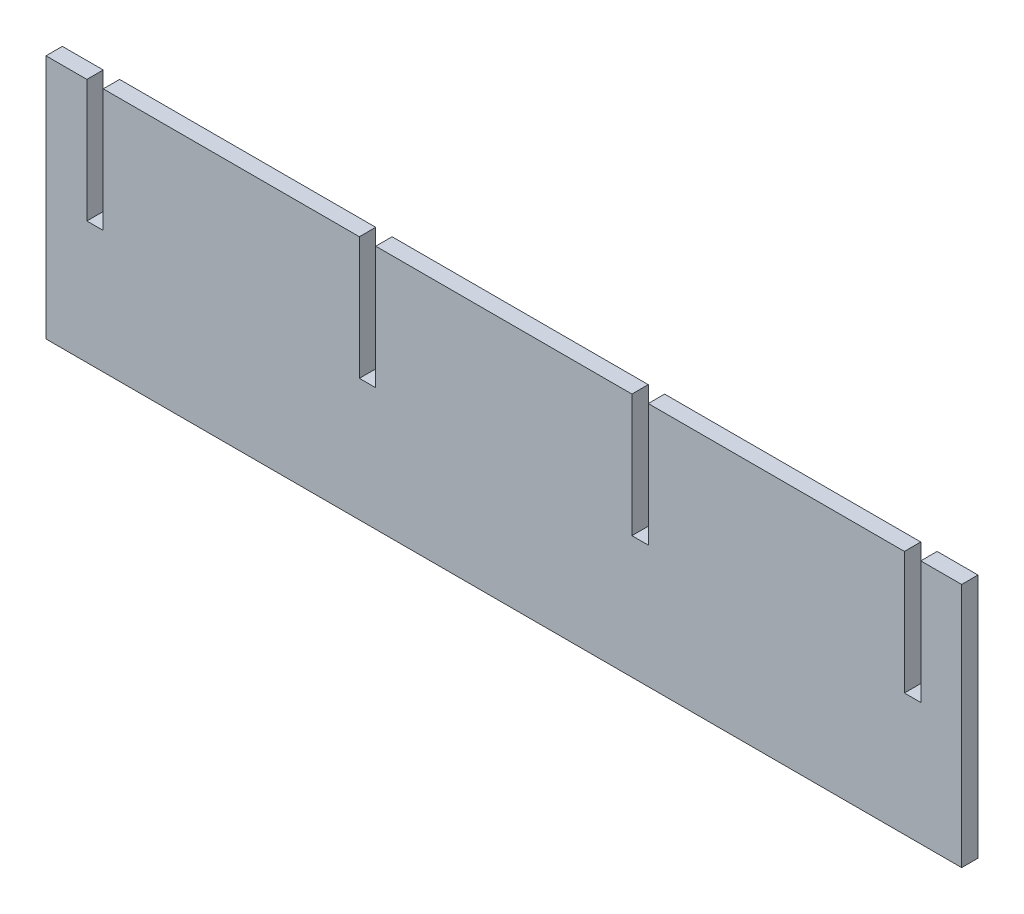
ISO-10303-21;
HEADER;
FILE_DESCRIPTION(('STEP AP214'),'2;1');
FILE_NAME('part.step','',(''),(''),'','','');
FILE_SCHEMA(('AUTOMOTIVE_DESIGN { 1 0 10303 214 1 1 1 1 }'));
ENDSEC;
DATA;
#1=APPLICATION_CONTEXT('core data for automotive mechanical design processes');
#2=APPLICATION_PROTOCOL_DEFINITION('international standard','automotive_design',2000,#1);
#3=PRODUCT_CONTEXT('',#1,'mechanical');
#4=PRODUCT('Part','Part','',(#3));
#5=PRODUCT_RELATED_PRODUCT_CATEGORY('part','',(#4));
#6=PRODUCT_DEFINITION_FORMATION('','',#4);
#7=PRODUCT_DEFINITION_CONTEXT('part definition',#1,'design');
#8=PRODUCT_DEFINITION('design','',#6,#7);
#9=PRODUCT_DEFINITION_SHAPE('','',#8);
#10=(LENGTH_UNIT() NAMED_UNIT(*) SI_UNIT(.MILLI.,.METRE.));
#11=(NAMED_UNIT(*) PLANE_ANGLE_UNIT() SI_UNIT($,.RADIAN.));
#12=(NAMED_UNIT(*) SI_UNIT($,.STERADIAN.) SOLID_ANGLE_UNIT());
#13=UNCERTAINTY_MEASURE_WITH_UNIT(LENGTH_MEASURE(1.E-05),#10,'distance_accuracy_value','');
#14=(GEOMETRIC_REPRESENTATION_CONTEXT(3) GLOBAL_UNCERTAINTY_ASSIGNED_CONTEXT((#13)) GLOBAL_UNIT_ASSIGNED_CONTEXT((#10,
#11,#12)) REPRESENTATION_CONTEXT('',''));
#15=CARTESIAN_POINT('',(0.,0.,0.));
#16=DIRECTION('',(0.,0.,1.));
#17=DIRECTION('',(1.,0.,0.));
#18=AXIS2_PLACEMENT_3D('',#15,#16,#17);
#19=CARTESIAN_POINT('',(0.,90.,12.));
#20=DIRECTION('',(0.,1.,0.));
#21=DIRECTION('',(-1.,0.,0.));
#22=AXIS2_PLACEMENT_3D('',#19,#20,#21);
#23=PLANE('',#22);
#24=DIRECTION('',(1.,0.,0.));
#25=VECTOR('',#24,1.);
#26=CARTESIAN_POINT('',(0.,90.,0.));
#27=LINE('',#26,#25);
#28=CARTESIAN_POINT('',(-294.,89.9999999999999,0.));
#29=VERTEX_POINT('',#28);
#30=CARTESIAN_POINT('',(-106.,90.,0.));
#31=VERTEX_POINT('',#30);
#32=EDGE_CURVE('E223',#29,#31,#27,.T.);
#33=ORIENTED_EDGE('',*,*,#32,.F.);
#34=DIRECTION('',(0.,0.,-1.));
#35=VECTOR('',#34,1.);
#36=CARTESIAN_POINT('',(-294.,89.9999999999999,12.));
#37=LINE('',#36,#35);
#38=CARTESIAN_POINT('',(-294.,89.9999999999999,12.));
#39=VERTEX_POINT('',#38);
#40=EDGE_CURVE('E11',#39,#29,#37,.T.);
#41=ORIENTED_EDGE('',*,*,#40,.F.);
#42=DIRECTION('',(1.,0.,0.));
#43=VECTOR('',#42,1.);
#44=CARTESIAN_POINT('',(0.,90.,12.));
#45=LINE('',#44,#43);
#46=CARTESIAN_POINT('',(-106.,90.,12.));
#47=VERTEX_POINT('',#46);
#48=EDGE_CURVE('E286',#39,#47,#45,.T.);
#49=ORIENTED_EDGE('',*,*,#48,.T.);
#50=DIRECTION('',(0.,0.,-1.));
#51=VECTOR('',#50,1.);
#52=CARTESIAN_POINT('',(-106.,90.,12.));
#53=LINE('',#52,#51);
#54=EDGE_CURVE('E67',#47,#31,#53,.T.);
#55=ORIENTED_EDGE('',*,*,#54,.T.);
#56=EDGE_LOOP('',(#33,#41,#49,#55));
#57=FACE_BOUND('',#56,.T.);
#58=ADVANCED_FACE('F49',(#57),#23,.T.);
#59=CARTESIAN_POINT('',(-294.,-1.81336427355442E-13,12.));
#60=DIRECTION('',(1.,0.,0.));
#61=DIRECTION('',(0.,1.,0.));
#62=AXIS2_PLACEMENT_3D('',#59,#60,#61);
#63=PLANE('',#62);
#64=DIRECTION('',(0.,-1.,0.));
#65=VECTOR('',#64,1.);
#66=CARTESIAN_POINT('',(-294.,-1.81336427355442E-13,0.));
#67=LINE('',#66,#65);
#68=CARTESIAN_POINT('',(-294.,0.,0.));
#69=VERTEX_POINT('',#68);
#70=EDGE_CURVE('E226',#29,#69,#67,.T.);
#71=ORIENTED_EDGE('',*,*,#70,.T.);
#72=DIRECTION('',(0.,0.,-1.));
#73=VECTOR('',#72,1.);
#74=CARTESIAN_POINT('',(-294.,0.,12.));
#75=LINE('',#74,#73);
#76=CARTESIAN_POINT('',(-294.,0.,12.));
#77=VERTEX_POINT('',#76);
#78=EDGE_CURVE('E59',#77,#69,#75,.T.);
#79=ORIENTED_EDGE('',*,*,#78,.F.);
#80=DIRECTION('',(0.,-1.,0.));
#81=VECTOR('',#80,1.);
#82=CARTESIAN_POINT('',(-294.,-1.81336427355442E-13,12.));
#83=LINE('',#82,#81);
#84=EDGE_CURVE('E359',#39,#77,#83,.T.);
#85=ORIENTED_EDGE('',*,*,#84,.F.);
#86=ORIENTED_EDGE('',*,*,#40,.T.);
#87=EDGE_LOOP('',(#71,#79,#85,#86));
#88=FACE_BOUND('',#87,.T.);
#89=ADVANCED_FACE('F51',(#88),#63,.F.);
#90=CARTESIAN_POINT('',(0.,0.,12.));
#91=DIRECTION('',(0.,1.,0.));
#92=DIRECTION('',(-1.,0.,0.));
#93=AXIS2_PLACEMENT_3D('',#90,#91,#92);
#94=PLANE('',#93);
#95=DIRECTION('',(1.,0.,0.));
#96=VECTOR('',#95,1.);
#97=CARTESIAN_POINT('',(0.,0.,0.));
#98=LINE('',#97,#96);
#99=CARTESIAN_POINT('',(-306.,0.,0.));
#100=VERTEX_POINT('',#99);
#101=EDGE_CURVE('E232',#100,#69,#98,.T.);
#102=ORIENTED_EDGE('',*,*,#101,.F.);
#103=DIRECTION('',(0.,0.,-1.));
#104=VECTOR('',#103,1.);
#105=CARTESIAN_POINT('',(-306.,0.,12.));
#106=LINE('',#105,#104);
#107=CARTESIAN_POINT('',(-306.,0.,12.));
#108=VERTEX_POINT('',#107);
#109=EDGE_CURVE('E333',#108,#100,#106,.T.);
#110=ORIENTED_EDGE('',*,*,#109,.F.);
#111=DIRECTION('',(1.,0.,0.));
#112=VECTOR('',#111,1.);
#113=CARTESIAN_POINT('',(0.,0.,12.));
#114=LINE('',#113,#112);
#115=EDGE_CURVE('E344',#108,#77,#114,.T.);
#116=ORIENTED_EDGE('',*,*,#115,.T.);
#117=ORIENTED_EDGE('',*,*,#78,.T.);
#118=EDGE_LOOP('',(#102,#110,#116,#117));
#119=FACE_BOUND('',#118,.T.);
#120=ADVANCED_FACE('F342',(#119),#94,.T.);
#121=CARTESIAN_POINT('',(-306.,-1.88737914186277E-13,12.));
#122=DIRECTION('',(1.,0.,0.));
#123=DIRECTION('',(0.,1.,0.));
#124=AXIS2_PLACEMENT_3D('',#121,#122,#123);
#125=PLANE('',#124);
#126=DIRECTION('',(0.,-1.,0.));
#127=VECTOR('',#126,1.);
#128=CARTESIAN_POINT('',(-306.,-1.88737914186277E-13,0.));
#129=LINE('',#128,#127);
#130=CARTESIAN_POINT('',(-306.,89.9999999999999,0.));
#131=VERTEX_POINT('',#130);
#132=EDGE_CURVE('E236',#131,#100,#129,.T.);
#133=ORIENTED_EDGE('',*,*,#132,.F.);
#134=DIRECTION('',(0.,0.,-1.));
#135=VECTOR('',#134,1.);
#136=CARTESIAN_POINT('',(-306.,89.9999999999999,12.));
#137=LINE('',#136,#135);
#138=CARTESIAN_POINT('',(-306.,89.9999999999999,12.));
#139=VERTEX_POINT('',#138);
#140=EDGE_CURVE('E330',#139,#131,#137,.T.);
#141=ORIENTED_EDGE('',*,*,#140,.F.);
#142=DIRECTION('',(0.,-1.,0.));
#143=VECTOR('',#142,1.);
#144=CARTESIAN_POINT('',(-306.,-1.88737914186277E-13,12.));
#145=LINE('',#144,#143);
#146=EDGE_CURVE('E356',#139,#108,#145,.T.);
#147=ORIENTED_EDGE('',*,*,#146,.T.);
#148=ORIENTED_EDGE('',*,*,#109,.T.);
#149=EDGE_LOOP('',(#133,#141,#147,#148));
#150=FACE_BOUND('',#149,.T.);
#151=ADVANCED_FACE('F353',(#150),#125,.T.);
#152=CARTESIAN_POINT('',(-336.,89.9999999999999,0.));
#153=VERTEX_POINT('',#152);
#154=EDGE_CURVE('E228',#153,#131,#27,.T.);
#155=ORIENTED_EDGE('',*,*,#154,.F.);
#156=DIRECTION('',(0.,0.,-1.));
#157=VECTOR('',#156,1.);
#158=CARTESIAN_POINT('',(-336.,89.9999999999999,12.));
#159=LINE('',#158,#157);
#160=CARTESIAN_POINT('',(-336.,89.9999999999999,12.));
#161=VERTEX_POINT('',#160);
#162=EDGE_CURVE('E327',#161,#153,#159,.T.);
#163=ORIENTED_EDGE('',*,*,#162,.F.);
#164=EDGE_CURVE('E366',#161,#139,#45,.T.);
#165=ORIENTED_EDGE('',*,*,#164,.T.);
#166=ORIENTED_EDGE('',*,*,#140,.T.);
#167=EDGE_LOOP('',(#155,#163,#165,#166));
#168=FACE_BOUND('',#167,.T.);
#169=ADVANCED_FACE('F486',(#168),#23,.T.);
#170=CARTESIAN_POINT('',(-336.,0.,12.));
#171=DIRECTION('',(-1.,0.,0.));
#172=DIRECTION('',(0.,0.,1.));
#173=AXIS2_PLACEMENT_3D('',#170,#171,#172);
#174=PLANE('',#173);
#175=DIRECTION('',(0.,1.,0.));
#176=VECTOR('',#175,1.);
#177=CARTESIAN_POINT('',(-336.,0.,0.));
#178=LINE('',#177,#176);
#179=CARTESIAN_POINT('',(-336.,-90.0000000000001,0.));
#180=VERTEX_POINT('',#179);
#181=EDGE_CURVE('E240',#180,#153,#178,.T.);
#182=ORIENTED_EDGE('',*,*,#181,.F.);
#183=DIRECTION('',(0.,0.,-1.));
#184=VECTOR('',#183,1.);
#185=CARTESIAN_POINT('',(-336.,-90.0000000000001,12.));
#186=LINE('',#185,#184);
#187=CARTESIAN_POINT('',(-336.,-90.0000000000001,12.));
#188=VERTEX_POINT('',#187);
#189=EDGE_CURVE('E324',#188,#180,#186,.T.);
#190=ORIENTED_EDGE('',*,*,#189,.F.);
#191=DIRECTION('',(0.,1.,0.));
#192=VECTOR('',#191,1.);
#193=CARTESIAN_POINT('',(-336.,0.,12.));
#194=LINE('',#193,#192);
#195=EDGE_CURVE('E371',#188,#161,#194,.T.);
#196=ORIENTED_EDGE('',*,*,#195,.T.);
#197=ORIENTED_EDGE('',*,*,#162,.T.);
#198=EDGE_LOOP('',(#182,#190,#196,#197));
#199=FACE_BOUND('',#198,.T.);
#200=ADVANCED_FACE('F495',(#199),#174,.T.);
#201=CARTESIAN_POINT('',(0.,-90.,12.));
#202=DIRECTION('',(0.,1.,0.));
#203=DIRECTION('',(-1.,0.,0.));
#204=AXIS2_PLACEMENT_3D('',#201,#202,#203);
#205=PLANE('',#204);
#206=DIRECTION('',(1.,0.,0.));
#207=VECTOR('',#206,1.);
#208=CARTESIAN_POINT('',(0.,-90.,0.));
#209=LINE('',#208,#207);
#210=CARTESIAN_POINT('',(336.,-90.,0.));
#211=VERTEX_POINT('',#210);
#212=EDGE_CURVE('E244',#180,#211,#209,.T.);
#213=ORIENTED_EDGE('',*,*,#212,.T.);
#214=DIRECTION('',(0.,0.,-1.));
#215=VECTOR('',#214,1.);
#216=CARTESIAN_POINT('',(336.,-90.,12.));
#217=LINE('',#216,#215);
#218=CARTESIAN_POINT('',(336.,-90.,12.));
#219=VERTEX_POINT('',#218);
#220=EDGE_CURVE('E320',#219,#211,#217,.T.);
#221=ORIENTED_EDGE('',*,*,#220,.F.);
#222=DIRECTION('',(1.,0.,0.));
#223=VECTOR('',#222,1.);
#224=CARTESIAN_POINT('',(0.,-90.,12.));
#225=LINE('',#224,#223);
#226=EDGE_CURVE('E375',#188,#219,#225,.T.);
#227=ORIENTED_EDGE('',*,*,#226,.F.);
#228=ORIENTED_EDGE('',*,*,#189,.T.);
#229=EDGE_LOOP('',(#213,#221,#227,#228));
#230=FACE_BOUND('',#229,.T.);
#231=ADVANCED_FACE('F601',(#230),#205,.F.);
#232=CARTESIAN_POINT('',(336.,0.,12.));
#233=DIRECTION('',(-1.,0.,0.));
#234=DIRECTION('',(0.,0.,1.));
#235=AXIS2_PLACEMENT_3D('',#232,#233,#234);
#236=PLANE('',#235);
#237=DIRECTION('',(0.,1.,0.));
#238=VECTOR('',#237,1.);
#239=CARTESIAN_POINT('',(336.,0.,0.));
#240=LINE('',#239,#238);
#241=CARTESIAN_POINT('',(336.,90.,0.));
#242=VERTEX_POINT('',#241);
#243=EDGE_CURVE('E247',#211,#242,#240,.T.);
#244=ORIENTED_EDGE('',*,*,#243,.T.);
#245=DIRECTION('',(0.,0.,-1.));
#246=VECTOR('',#245,1.);
#247=CARTESIAN_POINT('',(336.,90.,12.));
#248=LINE('',#247,#246);
#249=CARTESIAN_POINT('',(336.,90.,12.));
#250=VERTEX_POINT('',#249);
#251=EDGE_CURVE('E317',#250,#242,#248,.T.);
#252=ORIENTED_EDGE('',*,*,#251,.F.);
#253=DIRECTION('',(0.,1.,0.));
#254=VECTOR('',#253,1.);
#255=CARTESIAN_POINT('',(336.,0.,12.));
#256=LINE('',#255,#254);
#257=EDGE_CURVE('E378',#219,#250,#256,.T.);
#258=ORIENTED_EDGE('',*,*,#257,.F.);
#259=ORIENTED_EDGE('',*,*,#220,.T.);
#260=EDGE_LOOP('',(#244,#252,#258,#259));
#261=FACE_BOUND('',#260,.T.);
#262=ADVANCED_FACE('F436',(#261),#236,.F.);
#263=CARTESIAN_POINT('',(306.,90.,0.));
#264=VERTEX_POINT('',#263);
#265=EDGE_CURVE('E251',#264,#242,#27,.T.);
#266=ORIENTED_EDGE('',*,*,#265,.F.);
#267=DIRECTION('',(0.,0.,-1.));
#268=VECTOR('',#267,1.);
#269=CARTESIAN_POINT('',(306.,90.,12.));
#270=LINE('',#269,#268);
#271=CARTESIAN_POINT('',(306.,90.,12.));
#272=VERTEX_POINT('',#271);
#273=EDGE_CURVE('E314',#272,#264,#270,.T.);
#274=ORIENTED_EDGE('',*,*,#273,.F.);
#275=EDGE_CURVE('E381',#272,#250,#45,.T.);
#276=ORIENTED_EDGE('',*,*,#275,.T.);
#277=ORIENTED_EDGE('',*,*,#251,.T.);
#278=EDGE_LOOP('',(#266,#274,#276,#277));
#279=FACE_BOUND('',#278,.T.);
#280=ADVANCED_FACE('F426',(#279),#23,.T.);
#281=CARTESIAN_POINT('',(306.,1.88737914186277E-13,12.));
#282=DIRECTION('',(1.,0.,0.));
#283=DIRECTION('',(0.,1.,0.));
#284=AXIS2_PLACEMENT_3D('',#281,#282,#283);
#285=PLANE('',#284);
#286=DIRECTION('',(0.,-1.,0.));
#287=VECTOR('',#286,1.);
#288=CARTESIAN_POINT('',(306.,1.88737914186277E-13,0.));
#289=LINE('',#288,#287);
#290=CARTESIAN_POINT('',(306.,0.,0.));
#291=VERTEX_POINT('',#290);
#292=EDGE_CURVE('E252',#264,#291,#289,.T.);
#293=ORIENTED_EDGE('',*,*,#292,.T.);
#294=DIRECTION('',(0.,0.,-1.));
#295=VECTOR('',#294,1.);
#296=CARTESIAN_POINT('',(306.,0.,12.));
#297=LINE('',#296,#295);
#298=CARTESIAN_POINT('',(306.,0.,12.));
#299=VERTEX_POINT('',#298);
#300=EDGE_CURVE('E311',#299,#291,#297,.T.);
#301=ORIENTED_EDGE('',*,*,#300,.F.);
#302=DIRECTION('',(0.,-1.,0.));
#303=VECTOR('',#302,1.);
#304=CARTESIAN_POINT('',(306.,1.88737914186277E-13,12.));
#305=LINE('',#304,#303);
#306=EDGE_CURVE('E382',#272,#299,#305,.T.);
#307=ORIENTED_EDGE('',*,*,#306,.F.);
#308=ORIENTED_EDGE('',*,*,#273,.T.);
#309=EDGE_LOOP('',(#293,#301,#307,#308));
#310=FACE_BOUND('',#309,.T.);
#311=ADVANCED_FACE('F477',(#310),#285,.F.);
#312=CARTESIAN_POINT('',(0.,0.,12.));
#313=DIRECTION('',(0.,1.,0.));
#314=DIRECTION('',(-1.,0.,0.));
#315=AXIS2_PLACEMENT_3D('',#312,#313,#314);
#316=PLANE('',#315);
#317=DIRECTION('',(1.,0.,0.));
#318=VECTOR('',#317,1.);
#319=CARTESIAN_POINT('',(0.,0.,0.));
#320=LINE('',#319,#318);
#321=CARTESIAN_POINT('',(294.,0.,0.));
#322=VERTEX_POINT('',#321);
#323=EDGE_CURVE('E256',#322,#291,#320,.T.);
#324=ORIENTED_EDGE('',*,*,#323,.F.);
#325=DIRECTION('',(0.,0.,-1.));
#326=VECTOR('',#325,1.);
#327=CARTESIAN_POINT('',(294.,0.,12.));
#328=LINE('',#327,#326);
#329=CARTESIAN_POINT('',(294.,0.,12.));
#330=VERTEX_POINT('',#329);
#331=EDGE_CURVE('E308',#330,#322,#328,.T.);
#332=ORIENTED_EDGE('',*,*,#331,.F.);
#333=DIRECTION('',(1.,0.,0.));
#334=VECTOR('',#333,1.);
#335=CARTESIAN_POINT('',(0.,0.,12.));
#336=LINE('',#335,#334);
#337=EDGE_CURVE('E385',#330,#299,#336,.T.);
#338=ORIENTED_EDGE('',*,*,#337,.T.);
#339=ORIENTED_EDGE('',*,*,#300,.T.);
#340=EDGE_LOOP('',(#324,#332,#338,#339));
#341=FACE_BOUND('',#340,.T.);
#342=ADVANCED_FACE('F475',(#341),#316,.T.);
#343=CARTESIAN_POINT('',(294.,1.81336427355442E-13,12.));
#344=DIRECTION('',(1.,0.,0.));
#345=DIRECTION('',(0.,1.,0.));
#346=AXIS2_PLACEMENT_3D('',#343,#344,#345);
#347=PLANE('',#346);
#348=DIRECTION('',(0.,-1.,0.));
#349=VECTOR('',#348,1.);
#350=CARTESIAN_POINT('',(294.,1.81336427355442E-13,0.));
#351=LINE('',#350,#349);
#352=CARTESIAN_POINT('',(294.,90.,0.));
#353=VERTEX_POINT('',#352);
#354=EDGE_CURVE('E260',#353,#322,#351,.T.);
#355=ORIENTED_EDGE('',*,*,#354,.F.);
#356=DIRECTION('',(0.,0.,-1.));
#357=VECTOR('',#356,1.);
#358=CARTESIAN_POINT('',(294.,90.,12.));
#359=LINE('',#358,#357);
#360=CARTESIAN_POINT('',(294.,90.,12.));
#361=VERTEX_POINT('',#360);
#362=EDGE_CURVE('E305',#361,#353,#359,.T.);
#363=ORIENTED_EDGE('',*,*,#362,.F.);
#364=DIRECTION('',(0.,-1.,0.));
#365=VECTOR('',#364,1.);
#366=CARTESIAN_POINT('',(294.,1.81336427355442E-13,12.));
#367=LINE('',#366,#365);
#368=EDGE_CURVE('E389',#361,#330,#367,.T.);
#369=ORIENTED_EDGE('',*,*,#368,.T.);
#370=ORIENTED_EDGE('',*,*,#331,.T.);
#371=EDGE_LOOP('',(#355,#363,#369,#370));
#372=FACE_BOUND('',#371,.T.);
#373=ADVANCED_FACE('F472',(#372),#347,.T.);
#374=CARTESIAN_POINT('',(106.,90.,0.));
#375=VERTEX_POINT('',#374);
#376=EDGE_CURVE('E264',#375,#353,#27,.T.);
#377=ORIENTED_EDGE('',*,*,#376,.F.);
#378=DIRECTION('',(0.,0.,-1.));
#379=VECTOR('',#378,1.);
#380=CARTESIAN_POINT('',(106.,90.,12.));
#381=LINE('',#380,#379);
#382=CARTESIAN_POINT('',(106.,90.,12.));
#383=VERTEX_POINT('',#382);
#384=EDGE_CURVE('E302',#383,#375,#381,.T.);
#385=ORIENTED_EDGE('',*,*,#384,.F.);
#386=EDGE_CURVE('E393',#383,#361,#45,.T.);
#387=ORIENTED_EDGE('',*,*,#386,.T.);
#388=ORIENTED_EDGE('',*,*,#362,.T.);
#389=EDGE_LOOP('',(#377,#385,#387,#388));
#390=FACE_BOUND('',#389,.T.);
#391=ADVANCED_FACE('F466',(#390),#23,.T.);
#392=CARTESIAN_POINT('',(106.,0.,12.));
#393=DIRECTION('',(1.,0.,0.));
#394=DIRECTION('',(0.,1.,0.));
#395=AXIS2_PLACEMENT_3D('',#392,#393,#394);
#396=PLANE('',#395);
#397=DIRECTION('',(0.,-1.,0.));
#398=VECTOR('',#397,1.);
#399=CARTESIAN_POINT('',(106.,0.,0.));
#400=LINE('',#399,#398);
#401=CARTESIAN_POINT('',(106.,0.,0.));
#402=VERTEX_POINT('',#401);
#403=EDGE_CURVE('E265',#375,#402,#400,.T.);
#404=ORIENTED_EDGE('',*,*,#403,.T.);
#405=DIRECTION('',(0.,0.,-1.));
#406=VECTOR('',#405,1.);
#407=CARTESIAN_POINT('',(106.,0.,12.));
#408=LINE('',#407,#406);
#409=CARTESIAN_POINT('',(106.,0.,12.));
#410=VERTEX_POINT('',#409);
#411=EDGE_CURVE('E299',#410,#402,#408,.T.);
#412=ORIENTED_EDGE('',*,*,#411,.F.);
#413=DIRECTION('',(0.,-1.,0.));
#414=VECTOR('',#413,1.);
#415=CARTESIAN_POINT('',(106.,0.,12.));
#416=LINE('',#415,#414);
#417=EDGE_CURVE('E394',#383,#410,#416,.T.);
#418=ORIENTED_EDGE('',*,*,#417,.F.);
#419=ORIENTED_EDGE('',*,*,#384,.T.);
#420=EDGE_LOOP('',(#404,#412,#418,#419));
#421=FACE_BOUND('',#420,.T.);
#422=ADVANCED_FACE('F502',(#421),#396,.F.);
#423=CARTESIAN_POINT('',(0.,0.,12.));
#424=DIRECTION('',(0.,1.,0.));
#425=DIRECTION('',(-1.,0.,0.));
#426=AXIS2_PLACEMENT_3D('',#423,#424,#425);
#427=PLANE('',#426);
#428=DIRECTION('',(1.,0.,0.));
#429=VECTOR('',#428,1.);
#430=CARTESIAN_POINT('',(0.,0.,0.));
#431=LINE('',#430,#429);
#432=CARTESIAN_POINT('',(94.,0.,0.));
#433=VERTEX_POINT('',#432);
#434=EDGE_CURVE('E269',#433,#402,#431,.T.);
#435=ORIENTED_EDGE('',*,*,#434,.F.);
#436=DIRECTION('',(0.,0.,-1.));
#437=VECTOR('',#436,1.);
#438=CARTESIAN_POINT('',(94.,0.,12.));
#439=LINE('',#438,#437);
#440=CARTESIAN_POINT('',(94.,0.,12.));
#441=VERTEX_POINT('',#440);
#442=EDGE_CURVE('E296',#441,#433,#439,.T.);
#443=ORIENTED_EDGE('',*,*,#442,.F.);
#444=DIRECTION('',(1.,0.,0.));
#445=VECTOR('',#444,1.);
#446=CARTESIAN_POINT('',(0.,0.,12.));
#447=LINE('',#446,#445);
#448=EDGE_CURVE('E397',#441,#410,#447,.T.);
#449=ORIENTED_EDGE('',*,*,#448,.T.);
#450=ORIENTED_EDGE('',*,*,#411,.T.);
#451=EDGE_LOOP('',(#435,#443,#449,#450));
#452=FACE_BOUND('',#451,.T.);
#453=ADVANCED_FACE('F462',(#452),#427,.T.);
#454=CARTESIAN_POINT('',(94.,0.,12.));
#455=DIRECTION('',(1.,0.,0.));
#456=DIRECTION('',(0.,1.,0.));
#457=AXIS2_PLACEMENT_3D('',#454,#455,#456);
#458=PLANE('',#457);
#459=DIRECTION('',(0.,-1.,0.));
#460=VECTOR('',#459,1.);
#461=CARTESIAN_POINT('',(94.,0.,0.));
#462=LINE('',#461,#460);
#463=CARTESIAN_POINT('',(93.9999999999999,90.,0.));
#464=VERTEX_POINT('',#463);
#465=EDGE_CURVE('E273',#464,#433,#462,.T.);
#466=ORIENTED_EDGE('',*,*,#465,.F.);
#467=DIRECTION('',(0.,0.,-1.));
#468=VECTOR('',#467,1.);
#469=CARTESIAN_POINT('',(93.9999999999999,90.,12.));
#470=LINE('',#469,#468);
#471=CARTESIAN_POINT('',(93.9999999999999,90.,12.));
#472=VERTEX_POINT('',#471);
#473=EDGE_CURVE('E293',#472,#464,#470,.T.);
#474=ORIENTED_EDGE('',*,*,#473,.F.);
#475=DIRECTION('',(0.,-1.,0.));
#476=VECTOR('',#475,1.);
#477=CARTESIAN_POINT('',(94.,0.,12.));
#478=LINE('',#477,#476);
#479=EDGE_CURVE('E400',#472,#441,#478,.T.);
#480=ORIENTED_EDGE('',*,*,#479,.T.);
#481=ORIENTED_EDGE('',*,*,#442,.T.);
#482=EDGE_LOOP('',(#466,#474,#480,#481));
#483=FACE_BOUND('',#482,.T.);
#484=ADVANCED_FACE('F458',(#483),#458,.T.);
#485=CARTESIAN_POINT('',(-94.0000000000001,90.,0.));
#486=VERTEX_POINT('',#485);
#487=EDGE_CURVE('E227',#486,#464,#27,.T.);
#488=ORIENTED_EDGE('',*,*,#487,.F.);
#489=DIRECTION('',(0.,0.,-1.));
#490=VECTOR('',#489,1.);
#491=CARTESIAN_POINT('',(-94.0000000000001,90.,12.));
#492=LINE('',#491,#490);
#493=CARTESIAN_POINT('',(-94.0000000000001,90.,12.));
#494=VERTEX_POINT('',#493);
#495=EDGE_CURVE('E211',#494,#486,#492,.T.);
#496=ORIENTED_EDGE('',*,*,#495,.F.);
#497=EDGE_CURVE('E199',#494,#472,#45,.T.);
#498=ORIENTED_EDGE('',*,*,#497,.T.);
#499=ORIENTED_EDGE('',*,*,#473,.T.);
#500=EDGE_LOOP('',(#488,#496,#498,#499));
#501=FACE_BOUND('',#500,.T.);
#502=ADVANCED_FACE('F457',(#501),#23,.T.);
#503=CARTESIAN_POINT('',(-94.,0.,12.));
#504=DIRECTION('',(1.,0.,0.));
#505=DIRECTION('',(0.,1.,0.));
#506=AXIS2_PLACEMENT_3D('',#503,#504,#505);
#507=PLANE('',#506);
#508=DIRECTION('',(0.,-1.,0.));
#509=VECTOR('',#508,1.);
#510=CARTESIAN_POINT('',(-94.,0.,0.));
#511=LINE('',#510,#509);
#512=CARTESIAN_POINT('',(-94.,0.,0.));
#513=VERTEX_POINT('',#512);
#514=EDGE_CURVE('E207',#486,#513,#511,.T.);
#515=ORIENTED_EDGE('',*,*,#514,.T.);
#516=DIRECTION('',(0.,0.,-1.));
#517=VECTOR('',#516,1.);
#518=CARTESIAN_POINT('',(-94.,0.,12.));
#519=LINE('',#518,#517);
#520=CARTESIAN_POINT('',(-94.,0.,12.));
#521=VERTEX_POINT('',#520);
#522=EDGE_CURVE('E204',#521,#513,#519,.T.);
#523=ORIENTED_EDGE('',*,*,#522,.F.);
#524=DIRECTION('',(0.,-1.,0.));
#525=VECTOR('',#524,1.);
#526=CARTESIAN_POINT('',(-94.,0.,12.));
#527=LINE('',#526,#525);
#528=EDGE_CURVE('E190',#494,#521,#527,.T.);
#529=ORIENTED_EDGE('',*,*,#528,.F.);
#530=ORIENTED_EDGE('',*,*,#495,.T.);
#531=EDGE_LOOP('',(#515,#523,#529,#530));
#532=FACE_BOUND('',#531,.T.);
#533=ADVANCED_FACE('F205',(#532),#507,.F.);
#534=CARTESIAN_POINT('',(0.,0.,12.));
#535=DIRECTION('',(0.,1.,0.));
#536=DIRECTION('',(-1.,0.,0.));
#537=AXIS2_PLACEMENT_3D('',#534,#535,#536);
#538=PLANE('',#537);
#539=DIRECTION('',(1.,0.,0.));
#540=VECTOR('',#539,1.);
#541=CARTESIAN_POINT('',(0.,0.,0.));
#542=LINE('',#541,#540);
#543=CARTESIAN_POINT('',(-106.,0.,0.));
#544=VERTEX_POINT('',#543);
#545=EDGE_CURVE('E279',#544,#513,#542,.T.);
#546=ORIENTED_EDGE('',*,*,#545,.F.);
#547=DIRECTION('',(0.,0.,-1.));
#548=VECTOR('',#547,1.);
#549=CARTESIAN_POINT('',(-106.,0.,12.));
#550=LINE('',#549,#548);
#551=CARTESIAN_POINT('',(-106.,0.,12.));
#552=VERTEX_POINT('',#551);
#553=EDGE_CURVE('E128',#552,#544,#550,.T.);
#554=ORIENTED_EDGE('',*,*,#553,.F.);
#555=DIRECTION('',(1.,0.,0.));
#556=VECTOR('',#555,1.);
#557=CARTESIAN_POINT('',(0.,0.,12.));
#558=LINE('',#557,#556);
#559=EDGE_CURVE('E196',#552,#521,#558,.T.);
#560=ORIENTED_EDGE('',*,*,#559,.T.);
#561=ORIENTED_EDGE('',*,*,#522,.T.);
#562=EDGE_LOOP('',(#546,#554,#560,#561));
#563=FACE_BOUND('',#562,.T.);
#564=ADVANCED_FACE('F213',(#563),#538,.T.);
#565=CARTESIAN_POINT('',(-106.,0.,12.));
#566=DIRECTION('',(1.,0.,0.));
#567=DIRECTION('',(0.,1.,0.));
#568=AXIS2_PLACEMENT_3D('',#565,#566,#567);
#569=PLANE('',#568);
#570=DIRECTION('',(0.,-1.,0.));
#571=VECTOR('',#570,1.);
#572=CARTESIAN_POINT('',(-106.,0.,0.));
#573=LINE('',#572,#571);
#574=EDGE_CURVE('E282',#31,#544,#573,.T.);
#575=ORIENTED_EDGE('',*,*,#574,.F.);
#576=ORIENTED_EDGE('',*,*,#54,.F.);
#577=DIRECTION('',(0.,-1.,0.));
#578=VECTOR('',#577,1.);
#579=CARTESIAN_POINT('',(-106.,0.,12.));
#580=LINE('',#579,#578);
#581=EDGE_CURVE('E215',#47,#552,#580,.T.);
#582=ORIENTED_EDGE('',*,*,#581,.T.);
#583=ORIENTED_EDGE('',*,*,#553,.T.);
#584=EDGE_LOOP('',(#575,#576,#582,#583));
#585=FACE_BOUND('',#584,.T.);
#586=ADVANCED_FACE('F542',(#585),#569,.T.);
#587=CARTESIAN_POINT('',(0.,0.,12.));
#588=DIRECTION('',(0.,0.,1.));
#589=DIRECTION('',(1.,0.,0.));
#590=AXIS2_PLACEMENT_3D('',#587,#588,#589);
#591=PLANE('',#590);
#592=ORIENTED_EDGE('',*,*,#48,.F.);
#593=ORIENTED_EDGE('',*,*,#84,.T.);
#594=ORIENTED_EDGE('',*,*,#115,.F.);
#595=ORIENTED_EDGE('',*,*,#146,.F.);
#596=ORIENTED_EDGE('',*,*,#164,.F.);
#597=ORIENTED_EDGE('',*,*,#195,.F.);
#598=ORIENTED_EDGE('',*,*,#226,.T.);
#599=ORIENTED_EDGE('',*,*,#257,.T.);
#600=ORIENTED_EDGE('',*,*,#275,.F.);
#601=ORIENTED_EDGE('',*,*,#306,.T.);
#602=ORIENTED_EDGE('',*,*,#337,.F.);
#603=ORIENTED_EDGE('',*,*,#368,.F.);
#604=ORIENTED_EDGE('',*,*,#386,.F.);
#605=ORIENTED_EDGE('',*,*,#417,.T.);
#606=ORIENTED_EDGE('',*,*,#448,.F.);
#607=ORIENTED_EDGE('',*,*,#479,.F.);
#608=ORIENTED_EDGE('',*,*,#497,.F.);
#609=ORIENTED_EDGE('',*,*,#528,.T.);
#610=ORIENTED_EDGE('',*,*,#559,.F.);
#611=ORIENTED_EDGE('',*,*,#581,.F.);
#612=EDGE_LOOP('',(#592,#593,#594,#595,#596,#597,#598,#599,#600,#601,#602,#603,#604,#605,#606,
#607,#608,#609,#610,#611));
#613=FACE_BOUND('',#612,.T.);
#614=ADVANCED_FACE('F193',(#613),#591,.T.);
#615=CARTESIAN_POINT('',(0.,0.,0.));
#616=DIRECTION('',(0.,0.,1.));
#617=DIRECTION('',(1.,0.,0.));
#618=AXIS2_PLACEMENT_3D('',#615,#616,#617);
#619=PLANE('',#618);
#620=ORIENTED_EDGE('',*,*,#32,.T.);
#621=ORIENTED_EDGE('',*,*,#574,.T.);
#622=ORIENTED_EDGE('',*,*,#545,.T.);
#623=ORIENTED_EDGE('',*,*,#514,.F.);
#624=ORIENTED_EDGE('',*,*,#487,.T.);
#625=ORIENTED_EDGE('',*,*,#465,.T.);
#626=ORIENTED_EDGE('',*,*,#434,.T.);
#627=ORIENTED_EDGE('',*,*,#403,.F.);
#628=ORIENTED_EDGE('',*,*,#376,.T.);
#629=ORIENTED_EDGE('',*,*,#354,.T.);
#630=ORIENTED_EDGE('',*,*,#323,.T.);
#631=ORIENTED_EDGE('',*,*,#292,.F.);
#632=ORIENTED_EDGE('',*,*,#265,.T.);
#633=ORIENTED_EDGE('',*,*,#243,.F.);
#634=ORIENTED_EDGE('',*,*,#212,.F.);
#635=ORIENTED_EDGE('',*,*,#181,.T.);
#636=ORIENTED_EDGE('',*,*,#154,.T.);
#637=ORIENTED_EDGE('',*,*,#132,.T.);
#638=ORIENTED_EDGE('',*,*,#101,.T.);
#639=ORIENTED_EDGE('',*,*,#70,.F.);
#640=EDGE_LOOP('',(#620,#621,#622,#623,#624,#625,#626,#627,#628,#629,#630,#631,#632,#633,#634,
#635,#636,#637,#638,#639));
#641=FACE_BOUND('',#640,.T.);
#642=ADVANCED_FACE('F348',(#641),#619,.F.);
#643=CLOSED_SHELL('',(#58,#89,#120,#151,#169,#200,#231,#262,#280,#311,#342,#373,#391,#422,#453,
#484,#502,#533,#564,#586,#614,#642));
#644=MANIFOLD_SOLID_BREP('B2',#643);
#645=ADVANCED_BREP_SHAPE_REPRESENTATION('',(#18,#644),#14);
#646=SHAPE_DEFINITION_REPRESENTATION(#9,#645);
ENDSEC;
END-ISO-10303-21;
